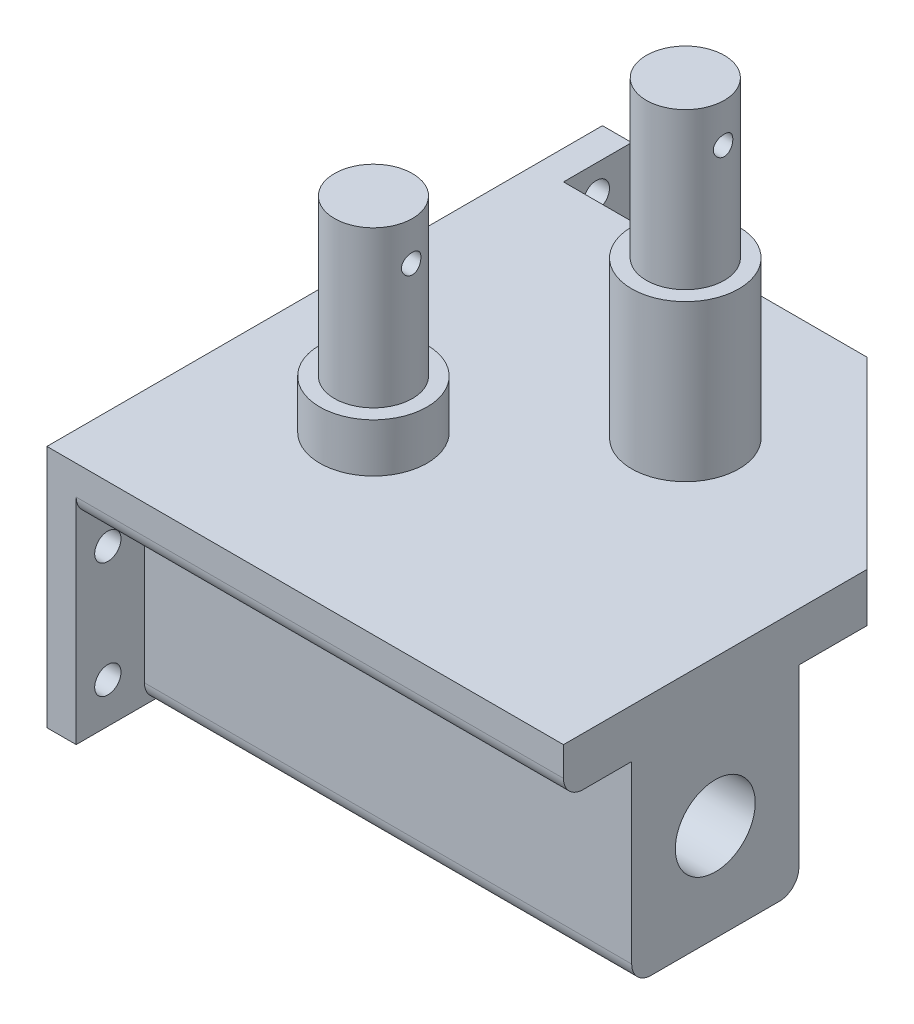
from build123d import *

# Parameters (mm, degrees)
BOSS_EXTRUDE1_DEPTH     = 5
SKETCH2_W               = 50
SKETCH2_H               = 17.15
BOSS_EXTRUDE2_DEPTH     = 20
SKETCH3_R               = 4.1
CUT_EXTRUDE1_DEPTH      = 30
FILLET1_R               = 2
SKETCH5_R               = 5.5
BOSS_EXTRUDE3_DEPTH     = 5
SKETCH8_W               = 57
SKETCH8_H               = 25
BOSS_EXTRUDE5_DEPTH     = 3
CUT_EXTRUDE2_DEPTH      = 63.327903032
CUT_EXTRUDE2_DEPTH_BACK = 63.327903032
SKETCH9_R               = 1.35
SKETCH10_R              = 4
BOSS_EXTRUDE6_DEPTH     = 16
SKETCH11_R              = 5.5
BOSS_EXTRUDE7_DEPTH     = 11
SKETCH12_R              = 4
BOSS_EXTRUDE8_DEPTH     = 16
CUT_EXTRUDE3_DEPTH      = 72.85240077
CUT_EXTRUDE3_DEPTH_BACK = 72.85240077
SKETCH13_R              = 1


with BuildPart() as part:
    # Sketch1 → Boss-Extrude1 (new body)
    with BuildSketch(Plane(origin=(0, 0, 0), x_dir=(1, 0, 0), z_dir=(0, 1, 0))):
        Polygon((5.529592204, -25.618994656), (24.381005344, -25.618994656), (24.381005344, -6.767581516), (24.381005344, 5.531005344), (5.531005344, 24.381005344), (-25.618994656, 24.381005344), (-25.618994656, -25.618994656), align=None)
    extrude(amount=BOSS_EXTRUDE1_DEPTH)

    # Sketch2 → Boss-Extrude2 (add)
    with BuildSketch(Plane.XZ):
        with Locations((-0.618994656, 10.043994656)):
            Rectangle(SKETCH2_W, SKETCH2_H)
    extrude(amount=BOSS_EXTRUDE2_DEPTH)

    # Sketch3 → Cut-Extrude1 (cut)
    with BuildSketch(Plane(origin=(24.381005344, 0, 0), x_dir=(0, 0, -1), z_dir=(1, 0, 0))):
        with Locations((-10.043994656, -10)):
            Circle(SKETCH3_R)
    extrude(amount=-CUT_EXTRUDE1_DEPTH, mode=Mode.SUBTRACT)

    # Fillet1
    fillet1_edges = [part.edges().sort_by_distance(p)[0] for p in [
        (-0.618994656, -20, 18.618994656),
        (-0.618994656, -20, 1.468994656),
        (-10.043994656, 0, -24.381005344),
        (-0.618994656, 0, 25.618994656),
    ]]
    fillet(fillet1_edges, radius=FILLET1_R)

    # Sketch5 → Boss-Extrude3 (add)
    with BuildSketch(Plane(origin=(0, 5, 0), x_dir=(1, 0, 0), z_dir=(0, 1, 0))):
        with Locations(Location((3.381005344, 7.881005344, 0), (0, 0, 90))):
            Circle(SKETCH5_R)
        with Locations(Location((-13.118994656, -7.618994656, 0), (0, 0, 90))):
            Circle(SKETCH5_R)
    extrude(amount=BOSS_EXTRUDE3_DEPTH)

    # Sketch8 → Boss-Extrude5 (add)
    with BuildSketch(Plane.ZY.offset(25.618994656)):
        with Locations((-2.881005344, -7.5)):
            Rectangle(SKETCH8_W, SKETCH8_H)
    extrude(amount=BOSS_EXTRUDE5_DEPTH)

    # Sketch9 → Cut-Extrude2 (cut, two sides: drawn at the far end of the back side and taken through both)
    with BuildSketch(Plane(origin=(-25.618994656, 0, 0), x_dir=(0, 0, -1), z_dir=(1, 0, 0)).offset(-CUT_EXTRUDE2_DEPTH_BACK)):
        with Locations((27.752661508, 2.091741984)):
            Circle(SKETCH9_R)
        with Locations((27.752661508, -15.858034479)):
            Circle(SKETCH9_R)
        with Locations((-22.368199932, -15.858034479)):
            Circle(SKETCH9_R)
        with Locations((-22.368199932, -3.996043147)):
            Circle(SKETCH9_R)
    extrude(amount=CUT_EXTRUDE2_DEPTH + CUT_EXTRUDE2_DEPTH_BACK, mode=Mode.SUBTRACT)

    # Sketch10 → Boss-Extrude6 (add)
    with BuildSketch(Plane(origin=(0, 10, 0), x_dir=(1, 0, 0), z_dir=(0, 1, 0))):
        with Locations(Location((-13.118994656, -7.618994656, 0), (0, 0, 270))):
            Circle(SKETCH10_R)
    extrude(amount=BOSS_EXTRUDE6_DEPTH)

    # Sketch11 → Boss-Extrude7 (add)
    with BuildSketch(Plane(origin=(0, 10, 0), x_dir=(1, 0, 0), z_dir=(0, 1, 0))):
        with Locations(Location((3.381005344, 7.881005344, 0), (0, 0, 90))):
            Circle(SKETCH11_R)
    extrude(amount=BOSS_EXTRUDE7_DEPTH)

    # Sketch12 → Boss-Extrude8 (add)
    with BuildSketch(Plane(origin=(0, 21, 0), x_dir=(1, 0, 0), z_dir=(0, 1, 0))):
        with Locations(Location((3.381005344, 7.881005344, 0), (0, 0, 270))):
            Circle(SKETCH12_R)
    extrude(amount=BOSS_EXTRUDE8_DEPTH)

    # Sketch13 → Cut-Extrude3 (cut, two sides: drawn at the far end of the back side and taken through both)
    with BuildSketch(Plane.ZY.offset(28.618994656).offset(-CUT_EXTRUDE3_DEPTH_BACK)):
        with Locations((7.618994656, 22)):
            Circle(SKETCH13_R)
        with Locations((-7.881005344, 33)):
            Circle(SKETCH13_R)
    extrude(amount=CUT_EXTRUDE3_DEPTH + CUT_EXTRUDE3_DEPTH_BACK, mode=Mode.SUBTRACT)


solid = part.part
